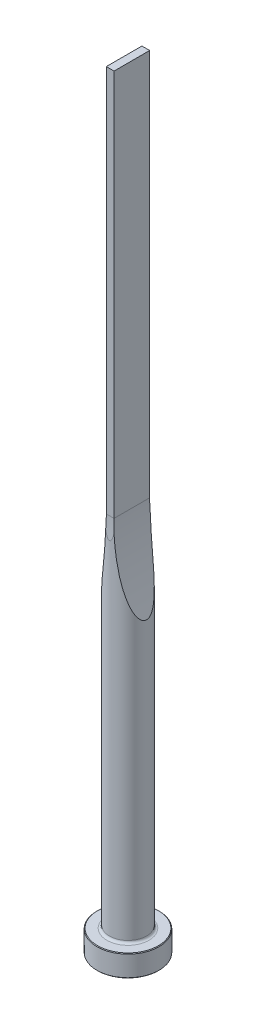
from build123d import *

# Parameters (mm, degrees)
CUT_EXTRUDE1_DEPTH = 7.5
CUT_EXTRUDE2_DEPTH = 7.5


with BuildPart() as part:
    # Sketch1 → Revolve1 (revolve)
    with BuildSketch(Plane.XY, mode=Mode.PRIVATE) as revolve1_sk:
        with BuildLine():
            Line((0, 0), (9.8, 0))
            Line((9.8, 0), (10, 0.2))
            Line((10, 0.2), (10, 6.8))
            Line((10, 6.8), (9.8, 7))
            Line((9.8, 7), (6.8, 7))
            ThreePointArc((6.8, 7), (6.234314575, 7.234314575), (6, 7.8))
            Line((6, 7.8), (6, 250))
            Line((6, 250), (0, 250))
            Line((0, 250), (0, 0))
        make_face()
    revolve(revolve1_sk.sketch.rotate(Axis((0, 250, 0), (0, -1, 0)), 180), axis=Axis((0, 250, 0), (0, -1, 0)))

    # Sketch2 → Cut-Extrude1 (cut, symmetric)
    with BuildSketch(Plane.XY):
        with BuildLine():
            Line((1.25, 250), (1.25, 125))
            ThreePointArc((1.25, 125), (2.445439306, 110.379808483), (6, 96.148007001))
            Line((6, 96.148007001), (6, 250))
            Line((6, 250), (1.25, 250))
        make_face()
        with BuildLine():
            Line((-1.25, 250), (-1.25, 125))
            ThreePointArc((-1.25, 125), (-2.445439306, 110.379808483), (-6, 96.148007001))
            Line((-6, 96.148007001), (-6, 250))
            Line((-6, 250), (-1.25, 250))
        make_face()
    extrude(amount=CUT_EXTRUDE1_DEPTH, both=True, mode=Mode.SUBTRACT)

    # Sketch3 → Cut-Extrude2 (cut, symmetric)
    with BuildSketch(Plane(origin=(0, 0, 0), x_dir=(0, 0, -1), z_dir=(1, 0, 0))):
        with BuildLine():
            Line((5.75, 250), (5.75, 125))
            ThreePointArc((5.75, 125), (5.812521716, 121.645898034), (6, 118.296456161))
            Line((6, 118.296456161), (6, 250))
            Line((6, 250), (5.75, 250))
        make_face()
        with BuildLine():
            Line((-5.75, 250), (-5.75, 125))
            ThreePointArc((-5.75, 125), (-5.812521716, 121.645898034), (-6, 118.296456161))
            Line((-6, 118.296456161), (-6, 250))
            Line((-6, 250), (-5.75, 250))
        make_face()
    extrude(amount=CUT_EXTRUDE2_DEPTH, both=True, mode=Mode.SUBTRACT)


solid = part.part
